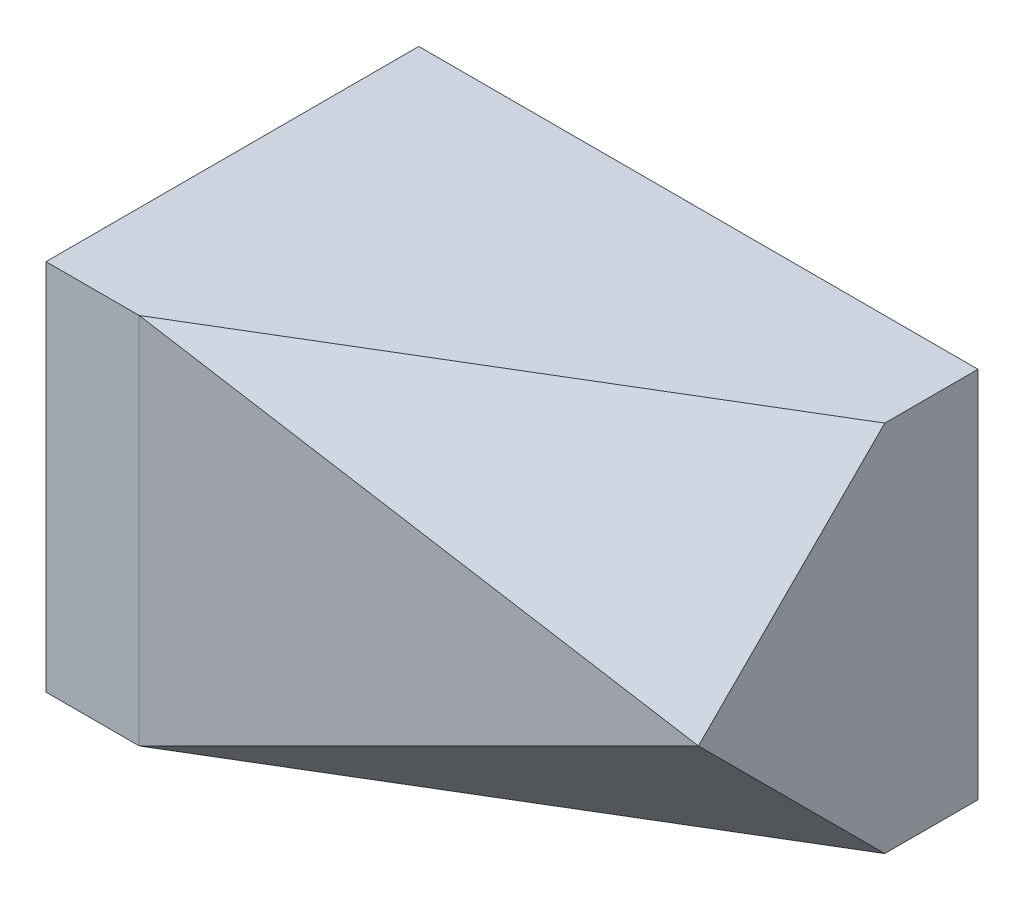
ISO-10303-21;
HEADER;
FILE_DESCRIPTION(('STEP AP214'),'2;1');
FILE_NAME('part.step','',(''),(''),'','','');
FILE_SCHEMA(('AUTOMOTIVE_DESIGN { 1 0 10303 214 1 1 1 1 }'));
ENDSEC;
DATA;
#1=APPLICATION_CONTEXT('core data for automotive mechanical design processes');
#2=APPLICATION_PROTOCOL_DEFINITION('international standard','automotive_design',2000,#1);
#3=PRODUCT_CONTEXT('',#1,'mechanical');
#4=PRODUCT('Part','Part','',(#3));
#5=PRODUCT_RELATED_PRODUCT_CATEGORY('part','',(#4));
#6=PRODUCT_DEFINITION_FORMATION('','',#4);
#7=PRODUCT_DEFINITION_CONTEXT('part definition',#1,'design');
#8=PRODUCT_DEFINITION('design','',#6,#7);
#9=PRODUCT_DEFINITION_SHAPE('','',#8);
#10=(LENGTH_UNIT() NAMED_UNIT(*) SI_UNIT(.MILLI.,.METRE.));
#11=(NAMED_UNIT(*) PLANE_ANGLE_UNIT() SI_UNIT($,.RADIAN.));
#12=(NAMED_UNIT(*) SI_UNIT($,.STERADIAN.) SOLID_ANGLE_UNIT());
#13=UNCERTAINTY_MEASURE_WITH_UNIT(LENGTH_MEASURE(1.E-05),#10,'distance_accuracy_value','');
#14=(GEOMETRIC_REPRESENTATION_CONTEXT(3) GLOBAL_UNCERTAINTY_ASSIGNED_CONTEXT((#13)) GLOBAL_UNIT_ASSIGNED_CONTEXT((#10,
#11,#12)) REPRESENTATION_CONTEXT('',''));
#15=CARTESIAN_POINT('',(0.,0.,0.));
#16=DIRECTION('',(0.,0.,1.));
#17=DIRECTION('',(1.,0.,0.));
#18=AXIS2_PLACEMENT_3D('',#15,#16,#17);
#19=CARTESIAN_POINT('',(-30.,20.,40.));
#20=DIRECTION('',(0.,-1.,0.));
#21=DIRECTION('',(0.,0.,-1.));
#22=AXIS2_PLACEMENT_3D('',#19,#20,#21);
#23=PLANE('',#22);
#24=DIRECTION('',(0.980580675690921,0.,-0.196116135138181));
#25=VECTOR('',#24,1.);
#26=CARTESIAN_POINT('',(-20.0000000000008,20.,40.));
#27=LINE('',#26,#25);
#28=CARTESIAN_POINT('',(-20.0000000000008,20.,40.));
#29=VERTEX_POINT('',#28);
#30=CARTESIAN_POINT('',(-19.9998086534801,20.,39.9999617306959));
#31=VERTEX_POINT('',#30);
#32=EDGE_CURVE('E52',#29,#31,#27,.T.);
#33=ORIENTED_EDGE('',*,*,#32,.T.);
#34=DIRECTION('',(0.85749234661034,0.,-0.514496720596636));
#35=VECTOR('',#34,1.);
#36=CARTESIAN_POINT('',(-27.3528974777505,20.,44.4118262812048));
#37=LINE('',#36,#35);
#38=CARTESIAN_POINT('',(30.,20.,10.));
#39=VERTEX_POINT('',#38);
#40=EDGE_CURVE('E11',#31,#39,#37,.T.);
#41=ORIENTED_EDGE('',*,*,#40,.T.);
#42=DIRECTION('',(0.,0.,-1.));
#43=VECTOR('',#42,1.);
#44=CARTESIAN_POINT('',(30.,20.,40.));
#45=LINE('',#44,#43);
#46=CARTESIAN_POINT('',(30.,20.,0.));
#47=VERTEX_POINT('',#46);
#48=EDGE_CURVE('E97',#39,#47,#45,.T.);
#49=ORIENTED_EDGE('',*,*,#48,.T.);
#50=DIRECTION('',(-1.,0.,0.));
#51=VECTOR('',#50,1.);
#52=CARTESIAN_POINT('',(-30.,20.,0.));
#53=LINE('',#52,#51);
#54=CARTESIAN_POINT('',(-30.,20.,0.));
#55=VERTEX_POINT('',#54);
#56=EDGE_CURVE('E122',#47,#55,#53,.T.);
#57=ORIENTED_EDGE('',*,*,#56,.T.);
#58=DIRECTION('',(0.,0.,-1.));
#59=VECTOR('',#58,1.);
#60=CARTESIAN_POINT('',(-30.,20.,40.));
#61=LINE('',#60,#59);
#62=CARTESIAN_POINT('',(-30.,20.,40.));
#63=VERTEX_POINT('',#62);
#64=EDGE_CURVE('E118',#63,#55,#61,.T.);
#65=ORIENTED_EDGE('',*,*,#64,.F.);
#66=DIRECTION('',(-1.,0.,0.));
#67=VECTOR('',#66,1.);
#68=CARTESIAN_POINT('',(-30.,20.,40.));
#69=LINE('',#68,#67);
#70=EDGE_CURVE('E121',#29,#63,#69,.T.);
#71=ORIENTED_EDGE('',*,*,#70,.F.);
#72=EDGE_LOOP('',(#33,#41,#49,#57,#65,#71));
#73=FACE_BOUND('',#72,.T.);
#74=ADVANCED_FACE('F31',(#73),#23,.F.);
#75=CARTESIAN_POINT('',(30.,20.,40.));
#76=DIRECTION('',(-1.,0.,0.));
#77=DIRECTION('',(0.,0.,1.));
#78=AXIS2_PLACEMENT_3D('',#75,#76,#77);
#79=PLANE('',#78);
#80=ORIENTED_EDGE('',*,*,#48,.F.);
#81=DIRECTION('',(0.,-0.707106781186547,0.707106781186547));
#82=VECTOR('',#81,1.);
#83=CARTESIAN_POINT('',(30.,5.,25.));
#84=LINE('',#83,#82);
#85=CARTESIAN_POINT('',(30.,0.,30.));
#86=VERTEX_POINT('',#85);
#87=EDGE_CURVE('E39',#39,#86,#84,.T.);
#88=ORIENTED_EDGE('',*,*,#87,.T.);
#89=DIRECTION('',(0.,0.707106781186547,0.707106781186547));
#90=VECTOR('',#89,1.);
#91=CARTESIAN_POINT('',(30.,15.,45.));
#92=LINE('',#91,#90);
#93=CARTESIAN_POINT('',(30.,-20.,9.99999999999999));
#94=VERTEX_POINT('',#93);
#95=EDGE_CURVE('E94',#94,#86,#92,.T.);
#96=ORIENTED_EDGE('',*,*,#95,.F.);
#97=DIRECTION('',(0.,0.,-1.));
#98=VECTOR('',#97,1.);
#99=CARTESIAN_POINT('',(30.,-20.,40.));
#100=LINE('',#99,#98);
#101=CARTESIAN_POINT('',(30.,-20.,0.));
#102=VERTEX_POINT('',#101);
#103=EDGE_CURVE('E115',#94,#102,#100,.T.);
#104=ORIENTED_EDGE('',*,*,#103,.T.);
#105=DIRECTION('',(0.,1.,0.));
#106=VECTOR('',#105,1.);
#107=CARTESIAN_POINT('',(30.,20.,0.));
#108=LINE('',#107,#106);
#109=EDGE_CURVE('E125',#102,#47,#108,.T.);
#110=ORIENTED_EDGE('',*,*,#109,.T.);
#111=EDGE_LOOP('',(#80,#88,#96,#104,#110));
#112=FACE_BOUND('',#111,.T.);
#113=ADVANCED_FACE('F93',(#112),#79,.F.);
#114=CARTESIAN_POINT('',(-20.0000000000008,-20.,40.));
#115=DIRECTION('',(0.196116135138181,0.,0.980580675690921));
#116=DIRECTION('',(0.980580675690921,0.,-0.196116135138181));
#117=AXIS2_PLACEMENT_3D('',#114,#115,#116);
#118=PLANE('',#117);
#119=DIRECTION('',(0.912870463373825,-0.365149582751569,-0.182574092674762));
#120=VECTOR('',#119,1.);
#121=CARTESIAN_POINT('',(-6.66660373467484,14.6666976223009,37.3333207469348));
#122=LINE('',#121,#120);
#123=EDGE_CURVE('E84',#31,#86,#122,.T.);
#124=ORIENTED_EDGE('',*,*,#123,.F.);
#125=ORIENTED_EDGE('',*,*,#32,.F.);
#126=DIRECTION('',(0.,1.,0.));
#127=VECTOR('',#126,1.);
#128=CARTESIAN_POINT('',(-20.0000000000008,20.,40.));
#129=LINE('',#128,#127);
#130=CARTESIAN_POINT('',(-20.0000000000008,-20.,40.));
#131=VERTEX_POINT('',#130);
#132=EDGE_CURVE('E110',#131,#29,#129,.T.);
#133=ORIENTED_EDGE('',*,*,#132,.F.);
#134=DIRECTION('',(-0.980580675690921,0.,0.196116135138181));
#135=VECTOR('',#134,1.);
#136=CARTESIAN_POINT('',(-20.0000000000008,-20.,40.));
#137=LINE('',#136,#135);
#138=CARTESIAN_POINT('',(-19.9998086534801,-20.,39.9999617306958));
#139=VERTEX_POINT('',#138);
#140=EDGE_CURVE('E104',#139,#131,#137,.T.);
#141=ORIENTED_EDGE('',*,*,#140,.F.);
#142=DIRECTION('',(0.912870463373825,0.365149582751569,-0.182574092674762));
#143=VECTOR('',#142,1.);
#144=CARTESIAN_POINT('',(-19.9999744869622,-20.0000663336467,39.9999948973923));
#145=LINE('',#144,#143);
#146=EDGE_CURVE('E87',#139,#86,#145,.T.);
#147=ORIENTED_EDGE('',*,*,#146,.T.);
#148=EDGE_LOOP('',(#124,#125,#133,#141,#147));
#149=FACE_BOUND('',#148,.T.);
#150=ADVANCED_FACE('F33',(#149),#118,.T.);
#151=CARTESIAN_POINT('',(-30.,20.,40.));
#152=DIRECTION('',(1.,0.,0.));
#153=DIRECTION('',(0.,0.,-1.));
#154=AXIS2_PLACEMENT_3D('',#151,#152,#153);
#155=PLANE('',#154);
#156=DIRECTION('',(0.,-1.,0.));
#157=VECTOR('',#156,1.);
#158=CARTESIAN_POINT('',(-30.,20.,0.));
#159=LINE('',#158,#157);
#160=CARTESIAN_POINT('',(-30.,-20.,0.));
#161=VERTEX_POINT('',#160);
#162=EDGE_CURVE('E130',#55,#161,#159,.T.);
#163=ORIENTED_EDGE('',*,*,#162,.T.);
#164=DIRECTION('',(0.,0.,-1.));
#165=VECTOR('',#164,1.);
#166=CARTESIAN_POINT('',(-30.,-20.,40.));
#167=LINE('',#166,#165);
#168=CARTESIAN_POINT('',(-30.,-20.,40.));
#169=VERTEX_POINT('',#168);
#170=EDGE_CURVE('E112',#169,#161,#167,.T.);
#171=ORIENTED_EDGE('',*,*,#170,.F.);
#172=DIRECTION('',(0.,-1.,0.));
#173=VECTOR('',#172,1.);
#174=CARTESIAN_POINT('',(-30.,20.,40.));
#175=LINE('',#174,#173);
#176=EDGE_CURVE('E124',#63,#169,#175,.T.);
#177=ORIENTED_EDGE('',*,*,#176,.F.);
#178=ORIENTED_EDGE('',*,*,#64,.T.);
#179=EDGE_LOOP('',(#163,#171,#177,#178));
#180=FACE_BOUND('',#179,.T.);
#181=ADVANCED_FACE('F145',(#180),#155,.F.);
#182=CARTESIAN_POINT('',(-30.,-20.,40.));
#183=DIRECTION('',(0.,1.,0.));
#184=DIRECTION('',(0.,0.,1.));
#185=AXIS2_PLACEMENT_3D('',#182,#183,#184);
#186=PLANE('',#185);
#187=DIRECTION('',(0.85749234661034,0.,-0.514496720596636));
#188=VECTOR('',#187,1.);
#189=CARTESIAN_POINT('',(-27.3528974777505,-20.,44.4118262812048));
#190=LINE('',#189,#188);
#191=EDGE_CURVE('E101',#139,#94,#190,.T.);
#192=ORIENTED_EDGE('',*,*,#191,.F.);
#193=ORIENTED_EDGE('',*,*,#140,.T.);
#194=DIRECTION('',(1.,0.,0.));
#195=VECTOR('',#194,1.);
#196=CARTESIAN_POINT('',(-30.,-20.,40.));
#197=LINE('',#196,#195);
#198=EDGE_CURVE('E134',#169,#131,#197,.T.);
#199=ORIENTED_EDGE('',*,*,#198,.F.);
#200=ORIENTED_EDGE('',*,*,#170,.T.);
#201=DIRECTION('',(1.,0.,0.));
#202=VECTOR('',#201,1.);
#203=CARTESIAN_POINT('',(-30.,-20.,0.));
#204=LINE('',#203,#202);
#205=EDGE_CURVE('E127',#161,#102,#204,.T.);
#206=ORIENTED_EDGE('',*,*,#205,.T.);
#207=ORIENTED_EDGE('',*,*,#103,.F.);
#208=EDGE_LOOP('',(#192,#193,#199,#200,#206,#207));
#209=FACE_BOUND('',#208,.T.);
#210=ADVANCED_FACE('F148',(#209),#186,.F.);
#211=CARTESIAN_POINT('',(-30.,-20.,40.));
#212=DIRECTION('',(0.,0.,1.));
#213=DIRECTION('',(1.,0.,0.));
#214=AXIS2_PLACEMENT_3D('',#211,#212,#213);
#215=PLANE('',#214);
#216=ORIENTED_EDGE('',*,*,#198,.T.);
#217=ORIENTED_EDGE('',*,*,#132,.T.);
#218=ORIENTED_EDGE('',*,*,#70,.T.);
#219=ORIENTED_EDGE('',*,*,#176,.T.);
#220=EDGE_LOOP('',(#216,#217,#218,#219));
#221=FACE_BOUND('',#220,.T.);
#222=ADVANCED_FACE('F141',(#221),#215,.T.);
#223=CARTESIAN_POINT('',(-30.,-20.,0.));
#224=DIRECTION('',(0.,0.,1.));
#225=DIRECTION('',(1.,0.,0.));
#226=AXIS2_PLACEMENT_3D('',#223,#224,#225);
#227=PLANE('',#226);
#228=ORIENTED_EDGE('',*,*,#162,.F.);
#229=ORIENTED_EDGE('',*,*,#56,.F.);
#230=ORIENTED_EDGE('',*,*,#109,.F.);
#231=ORIENTED_EDGE('',*,*,#205,.F.);
#232=EDGE_LOOP('',(#228,#229,#230,#231));
#233=FACE_BOUND('',#232,.T.);
#234=ADVANCED_FACE('F152',(#233),#227,.F.);
#235=CARTESIAN_POINT('',(30.1666660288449,0.133333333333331,30.0333334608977));
#236=DIRECTION('',(0.390567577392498,-0.650944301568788,0.650944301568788));
#237=DIRECTION('',(0.,-0.707106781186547,-0.707106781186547));
#238=AXIS2_PLACEMENT_3D('',#235,#236,#237);
#239=PLANE('',#238);
#240=ORIENTED_EDGE('',*,*,#146,.F.);
#241=ORIENTED_EDGE('',*,*,#191,.T.);
#242=ORIENTED_EDGE('',*,*,#95,.T.);
#243=EDGE_LOOP('',(#240,#241,#242));
#244=FACE_BOUND('',#243,.T.);
#245=ADVANCED_FACE('F99',(#244),#239,.T.);
#246=CARTESIAN_POINT('',(30.1666660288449,20.0666666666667,9.83333346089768));
#247=DIRECTION('',(-0.390567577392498,-0.650944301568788,-0.650944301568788));
#248=DIRECTION('',(0.,0.707106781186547,-0.707106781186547));
#249=AXIS2_PLACEMENT_3D('',#246,#247,#248);
#250=PLANE('',#249);
#251=ORIENTED_EDGE('',*,*,#40,.F.);
#252=ORIENTED_EDGE('',*,*,#123,.T.);
#253=ORIENTED_EDGE('',*,*,#87,.F.);
#254=EDGE_LOOP('',(#251,#252,#253));
#255=FACE_BOUND('',#254,.T.);
#256=ADVANCED_FACE('F85',(#255),#250,.F.);
#257=CLOSED_SHELL('',(#74,#113,#150,#181,#210,#222,#234,#245,#256));
#258=MANIFOLD_SOLID_BREP('B2',#257);
#259=ADVANCED_BREP_SHAPE_REPRESENTATION('',(#18,#258),#14);
#260=SHAPE_DEFINITION_REPRESENTATION(#9,#259);
ENDSEC;
END-ISO-10303-21;
